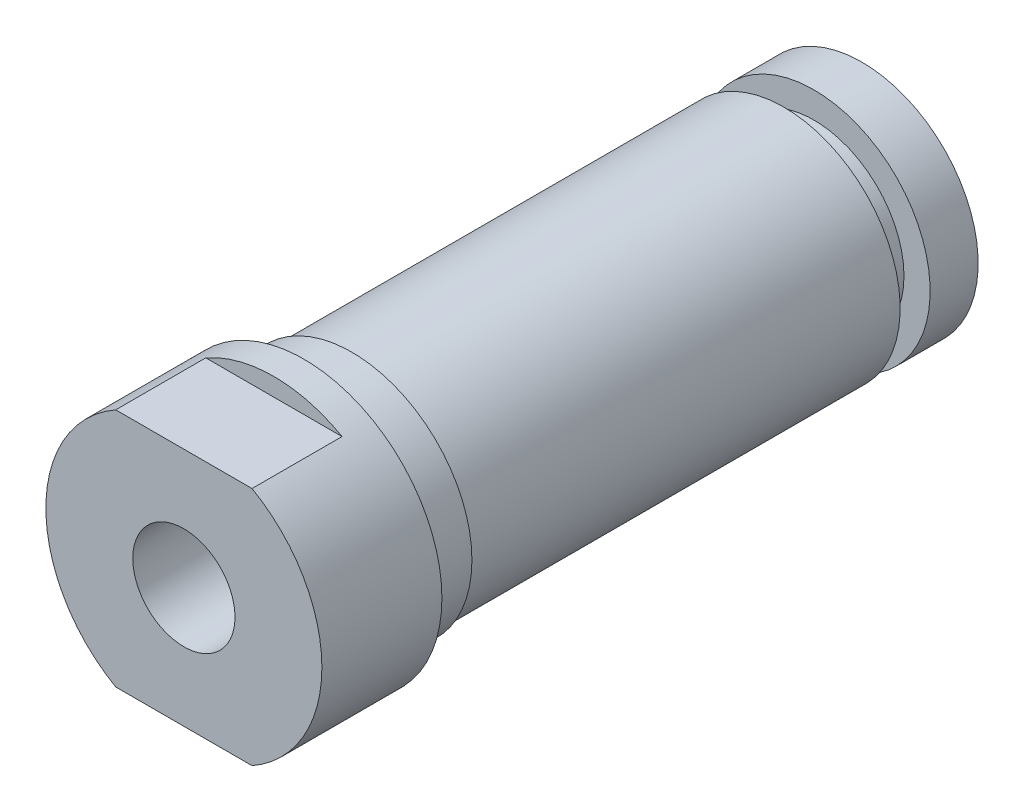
ISO-10303-21;
HEADER;
FILE_DESCRIPTION(('STEP AP214'),'2;1');
FILE_NAME('part.step','',(''),(''),'','','');
FILE_SCHEMA(('AUTOMOTIVE_DESIGN { 1 0 10303 214 1 1 1 1 }'));
ENDSEC;
DATA;
#1=APPLICATION_CONTEXT('core data for automotive mechanical design processes');
#2=APPLICATION_PROTOCOL_DEFINITION('international standard','automotive_design',2000,#1);
#3=PRODUCT_CONTEXT('',#1,'mechanical');
#4=PRODUCT('Part','Part','',(#3));
#5=PRODUCT_RELATED_PRODUCT_CATEGORY('part','',(#4));
#6=PRODUCT_DEFINITION_FORMATION('','',#4);
#7=PRODUCT_DEFINITION_CONTEXT('part definition',#1,'design');
#8=PRODUCT_DEFINITION('design','',#6,#7);
#9=PRODUCT_DEFINITION_SHAPE('','',#8);
#10=(LENGTH_UNIT() NAMED_UNIT(*) SI_UNIT(.MILLI.,.METRE.));
#11=(NAMED_UNIT(*) PLANE_ANGLE_UNIT() SI_UNIT($,.RADIAN.));
#12=(NAMED_UNIT(*) SI_UNIT($,.STERADIAN.) SOLID_ANGLE_UNIT());
#13=UNCERTAINTY_MEASURE_WITH_UNIT(LENGTH_MEASURE(1.E-05),#10,'distance_accuracy_value','');
#14=(GEOMETRIC_REPRESENTATION_CONTEXT(3) GLOBAL_UNCERTAINTY_ASSIGNED_CONTEXT((#13)) GLOBAL_UNIT_ASSIGNED_CONTEXT((#10,
#11,#12)) REPRESENTATION_CONTEXT('',''));
#15=CARTESIAN_POINT('',(0.,0.,0.));
#16=DIRECTION('',(0.,0.,1.));
#17=DIRECTION('',(1.,0.,0.));
#18=AXIS2_PLACEMENT_3D('',#15,#16,#17);
#19=CARTESIAN_POINT('',(0.,0.,0.));
#20=DIRECTION('',(0.,0.,1.));
#21=DIRECTION('',(1.,0.,0.));
#22=AXIS2_PLACEMENT_3D('',#19,#20,#21);
#23=PLANE('',#22);
#24=DIRECTION('',(1.,0.,0.));
#25=VECTOR('',#24,1.);
#26=CARTESIAN_POINT('',(-12.7,-6.35,0.));
#27=LINE('',#26,#25);
#28=CARTESIAN_POINT('',(-3.60610679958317,-6.35,0.));
#29=VERTEX_POINT('',#28);
#30=CARTESIAN_POINT('',(3.60610679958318,-6.35,0.));
#31=VERTEX_POINT('',#30);
#32=EDGE_CURVE('E91',#29,#31,#27,.T.);
#33=ORIENTED_EDGE('',*,*,#32,.T.);
#34=CARTESIAN_POINT('',(0.,0.,0.));
#35=DIRECTION('',(0.,0.,1.));
#36=DIRECTION('',(1.,0.,0.));
#37=AXIS2_PLACEMENT_3D('',#34,#35,#36);
#38=CIRCLE('',#37,7.3025);
#39=CARTESIAN_POINT('',(3.60610679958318,6.35,0.));
#40=VERTEX_POINT('',#39);
#41=EDGE_CURVE('E127',#31,#40,#38,.T.);
#42=ORIENTED_EDGE('',*,*,#41,.T.);
#43=DIRECTION('',(1.,0.,0.));
#44=VECTOR('',#43,1.);
#45=CARTESIAN_POINT('',(-12.7,6.35,0.));
#46=LINE('',#45,#44);
#47=CARTESIAN_POINT('',(-3.60610679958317,6.35,0.));
#48=VERTEX_POINT('',#47);
#49=EDGE_CURVE('E94',#48,#40,#46,.T.);
#50=ORIENTED_EDGE('',*,*,#49,.F.);
#51=EDGE_CURVE('E132',#48,#29,#38,.T.);
#52=ORIENTED_EDGE('',*,*,#51,.T.);
#53=EDGE_LOOP('',(#33,#42,#50,#52));
#54=FACE_BOUND('',#53,.T.);
#55=CARTESIAN_POINT('',(0.,0.,0.));
#56=DIRECTION('',(0.,0.,-1.));
#57=DIRECTION('',(-1.,0.,0.));
#58=AXIS2_PLACEMENT_3D('',#55,#56,#57);
#59=CIRCLE('',#58,2.70509999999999);
#60=CARTESIAN_POINT('',(-2.70509999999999,0.,0.));
#61=VERTEX_POINT('',#60);
#62=EDGE_CURVE('E98',#61,#61,#59,.T.);
#63=ORIENTED_EDGE('',*,*,#62,.T.);
#64=EDGE_LOOP('',(#63));
#65=FACE_BOUND('',#64,.T.);
#66=ADVANCED_FACE('F36',(#54,#65),#23,.T.);
#67=CARTESIAN_POINT('',(0.,0.,-31.75));
#68=DIRECTION('',(0.,0.,-1.));
#69=DIRECTION('',(-1.,0.,0.));
#70=AXIS2_PLACEMENT_3D('',#67,#68,#69);
#71=PLANE('',#70);
#72=CARTESIAN_POINT('',(0.,0.,-31.75));
#73=DIRECTION('',(0.,0.,-1.));
#74=DIRECTION('',(-1.,0.,0.));
#75=AXIS2_PLACEMENT_3D('',#72,#73,#74);
#76=CIRCLE('',#75,6.1468);
#77=CARTESIAN_POINT('',(-6.1468,0.,-31.75));
#78=VERTEX_POINT('',#77);
#79=EDGE_CURVE('E119',#78,#78,#76,.T.);
#80=ORIENTED_EDGE('',*,*,#79,.T.);
#81=EDGE_LOOP('',(#80));
#82=FACE_BOUND('',#81,.T.);
#83=CARTESIAN_POINT('',(0.,0.,-31.75));
#84=DIRECTION('',(0.,0.,-1.));
#85=DIRECTION('',(-1.,0.,0.));
#86=AXIS2_PLACEMENT_3D('',#83,#84,#85);
#87=CIRCLE('',#86,4.7625);
#88=CARTESIAN_POINT('',(-4.7625,0.,-31.75));
#89=VERTEX_POINT('',#88);
#90=EDGE_CURVE('E110',#89,#89,#87,.T.);
#91=ORIENTED_EDGE('',*,*,#90,.F.);
#92=EDGE_LOOP('',(#91));
#93=FACE_BOUND('',#92,.T.);
#94=ADVANCED_FACE('F158',(#82,#93),#71,.T.);
#95=CARTESIAN_POINT('',(0.,0.,-8.89));
#96=DIRECTION('',(0.,0.,-1.));
#97=DIRECTION('',(-1.,0.,0.));
#98=AXIS2_PLACEMENT_3D('',#95,#96,#97);
#99=PLANE('',#98);
#100=CARTESIAN_POINT('',(0.,0.,-8.89));
#101=DIRECTION('',(0.,0.,-1.));
#102=DIRECTION('',(-1.,0.,0.));
#103=AXIS2_PLACEMENT_3D('',#100,#101,#102);
#104=CIRCLE('',#103,6.35);
#105=CARTESIAN_POINT('',(-6.35,0.,-8.89));
#106=VERTEX_POINT('',#105);
#107=EDGE_CURVE('E122',#106,#106,#104,.T.);
#108=ORIENTED_EDGE('',*,*,#107,.T.);
#109=EDGE_LOOP('',(#108));
#110=FACE_BOUND('',#109,.T.);
#111=CARTESIAN_POINT('',(0.,0.,-8.89));
#112=DIRECTION('',(0.,0.,-1.));
#113=DIRECTION('',(-1.,0.,0.));
#114=AXIS2_PLACEMENT_3D('',#111,#112,#113);
#115=CIRCLE('',#114,6.1468);
#116=CARTESIAN_POINT('',(-6.1468,0.,-8.89));
#117=VERTEX_POINT('',#116);
#118=EDGE_CURVE('E116',#117,#117,#115,.T.);
#119=ORIENTED_EDGE('',*,*,#118,.F.);
#120=EDGE_LOOP('',(#119));
#121=FACE_BOUND('',#120,.T.);
#122=ADVANCED_FACE('F162',(#110,#121),#99,.T.);
#123=CARTESIAN_POINT('',(0.,0.,-6.35));
#124=DIRECTION('',(0.,0.,1.));
#125=DIRECTION('',(1.,0.,0.));
#126=AXIS2_PLACEMENT_3D('',#123,#124,#125);
#127=PLANE('',#126);
#128=CARTESIAN_POINT('',(0.,0.,-6.35));
#129=DIRECTION('',(0.,0.,1.));
#130=DIRECTION('',(1.,0.,0.));
#131=AXIS2_PLACEMENT_3D('',#128,#129,#130);
#132=CIRCLE('',#131,7.3025);
#133=CARTESIAN_POINT('',(7.3025,0.,-6.35));
#134=VERTEX_POINT('',#133);
#135=EDGE_CURVE('E128',#134,#134,#132,.T.);
#136=ORIENTED_EDGE('',*,*,#135,.F.);
#137=EDGE_LOOP('',(#136));
#138=FACE_BOUND('',#137,.T.);
#139=CARTESIAN_POINT('',(0.,0.,-6.35));
#140=DIRECTION('',(0.,0.,1.));
#141=DIRECTION('',(1.,0.,0.));
#142=AXIS2_PLACEMENT_3D('',#139,#140,#141);
#143=CIRCLE('',#142,6.35);
#144=CARTESIAN_POINT('',(6.35,0.,-6.35));
#145=VERTEX_POINT('',#144);
#146=EDGE_CURVE('E131',#145,#145,#143,.F.);
#147=ORIENTED_EDGE('',*,*,#146,.F.);
#148=EDGE_LOOP('',(#147));
#149=FACE_BOUND('',#148,.T.);
#150=ADVANCED_FACE('F166',(#138,#149),#127,.F.);
#151=CARTESIAN_POINT('',(0.,0.,-6.35));
#152=DIRECTION('',(0.,0.,1.));
#153=DIRECTION('',(1.,0.,0.));
#154=AXIS2_PLACEMENT_3D('',#151,#152,#153);
#155=CYLINDRICAL_SURFACE('',#154,7.3025);
#156=DIRECTION('',(0.,0.,1.));
#157=VECTOR('',#156,1.);
#158=CARTESIAN_POINT('',(-3.60610679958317,-6.35,-6.35));
#159=LINE('',#158,#157);
#160=CARTESIAN_POINT('',(-3.60610679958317,-6.35,-4.7625));
#161=VERTEX_POINT('',#160);
#162=EDGE_CURVE('E11',#29,#161,#159,.F.);
#163=ORIENTED_EDGE('',*,*,#162,.F.);
#164=ORIENTED_EDGE('',*,*,#51,.F.);
#165=DIRECTION('',(0.,0.,1.));
#166=VECTOR('',#165,1.);
#167=CARTESIAN_POINT('',(-3.60610679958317,6.35,-6.35));
#168=LINE('',#167,#166);
#169=CARTESIAN_POINT('',(-3.60610679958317,6.35,-4.7625));
#170=VERTEX_POINT('',#169);
#171=EDGE_CURVE('E136',#170,#48,#168,.T.);
#172=ORIENTED_EDGE('',*,*,#171,.F.);
#173=CARTESIAN_POINT('',(0.,0.,-4.7625));
#174=DIRECTION('',(0.,0.,-1.));
#175=DIRECTION('',(-1.,0.,0.));
#176=AXIS2_PLACEMENT_3D('',#173,#174,#175);
#177=CIRCLE('',#176,7.3025);
#178=CARTESIAN_POINT('',(3.60610679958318,6.35,-4.7625));
#179=VERTEX_POINT('',#178);
#180=EDGE_CURVE('E58',#179,#170,#177,.F.);
#181=ORIENTED_EDGE('',*,*,#180,.F.);
#182=DIRECTION('',(0.,0.,1.));
#183=VECTOR('',#182,1.);
#184=CARTESIAN_POINT('',(3.60610679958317,6.35,-6.35));
#185=LINE('',#184,#183);
#186=EDGE_CURVE('E85',#40,#179,#185,.F.);
#187=ORIENTED_EDGE('',*,*,#186,.F.);
#188=ORIENTED_EDGE('',*,*,#41,.F.);
#189=DIRECTION('',(0.,0.,1.));
#190=VECTOR('',#189,1.);
#191=CARTESIAN_POINT('',(3.60610679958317,-6.35,-6.35));
#192=LINE('',#191,#190);
#193=CARTESIAN_POINT('',(3.60610679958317,-6.35,-4.7625));
#194=VERTEX_POINT('',#193);
#195=EDGE_CURVE('E44',#194,#31,#192,.T.);
#196=ORIENTED_EDGE('',*,*,#195,.F.);
#197=CARTESIAN_POINT('',(0.,0.,-4.7625));
#198=DIRECTION('',(0.,0.,-1.));
#199=DIRECTION('',(-1.,0.,0.));
#200=AXIS2_PLACEMENT_3D('',#197,#198,#199);
#201=CIRCLE('',#200,7.3025);
#202=EDGE_CURVE('E77',#161,#194,#201,.F.);
#203=ORIENTED_EDGE('',*,*,#202,.F.);
#204=EDGE_LOOP('',(#163,#164,#172,#181,#187,#188,#196,#203));
#205=FACE_BOUND('',#204,.T.);
#206=ORIENTED_EDGE('',*,*,#135,.T.);
#207=EDGE_LOOP('',(#206));
#208=FACE_BOUND('',#207,.T.);
#209=ADVANCED_FACE('F38',(#205,#208),#155,.T.);
#210=CARTESIAN_POINT('',(0.,0.,-8.89));
#211=DIRECTION('',(0.,0.,1.));
#212=DIRECTION('',(1.,0.,0.));
#213=AXIS2_PLACEMENT_3D('',#210,#211,#212);
#214=CYLINDRICAL_SURFACE('',#213,6.35);
#215=ORIENTED_EDGE('',*,*,#107,.F.);
#216=EDGE_LOOP('',(#215));
#217=FACE_BOUND('',#216,.T.);
#218=ORIENTED_EDGE('',*,*,#146,.T.);
#219=EDGE_LOOP('',(#218));
#220=FACE_BOUND('',#219,.T.);
#221=ADVANCED_FACE('F170',(#217,#220),#214,.T.);
#222=CARTESIAN_POINT('',(0.,0.,-31.75));
#223=DIRECTION('',(0.,0.,1.));
#224=DIRECTION('',(1.,0.,0.));
#225=AXIS2_PLACEMENT_3D('',#222,#223,#224);
#226=CYLINDRICAL_SURFACE('',#225,6.1468);
#227=ORIENTED_EDGE('',*,*,#79,.F.);
#228=EDGE_LOOP('',(#227));
#229=FACE_BOUND('',#228,.T.);
#230=ORIENTED_EDGE('',*,*,#118,.T.);
#231=EDGE_LOOP('',(#230));
#232=FACE_BOUND('',#231,.T.);
#233=ADVANCED_FACE('F173',(#229,#232),#226,.T.);
#234=CARTESIAN_POINT('',(0.,0.,-33.3375));
#235=DIRECTION('',(0.,0.,1.));
#236=DIRECTION('',(1.,0.,0.));
#237=AXIS2_PLACEMENT_3D('',#234,#235,#236);
#238=CYLINDRICAL_SURFACE('',#237,4.7625);
#239=CARTESIAN_POINT('',(0.,0.,-33.3375));
#240=DIRECTION('',(0.,0.,-1.));
#241=DIRECTION('',(-1.,0.,0.));
#242=AXIS2_PLACEMENT_3D('',#239,#240,#241);
#243=CIRCLE('',#242,4.7625);
#244=CARTESIAN_POINT('',(-4.7625,0.,-33.3375));
#245=VERTEX_POINT('',#244);
#246=EDGE_CURVE('E113',#245,#245,#243,.T.);
#247=ORIENTED_EDGE('',*,*,#246,.F.);
#248=EDGE_LOOP('',(#247));
#249=FACE_BOUND('',#248,.T.);
#250=ORIENTED_EDGE('',*,*,#90,.T.);
#251=EDGE_LOOP('',(#250));
#252=FACE_BOUND('',#251,.T.);
#253=ADVANCED_FACE('F179',(#249,#252),#238,.T.);
#254=CARTESIAN_POINT('',(0.,0.,-33.3375));
#255=DIRECTION('',(0.,0.,-1.));
#256=DIRECTION('',(-1.,0.,0.));
#257=AXIS2_PLACEMENT_3D('',#254,#255,#256);
#258=PLANE('',#257);
#259=CARTESIAN_POINT('',(0.,0.,-33.3375));
#260=DIRECTION('',(0.,0.,-1.));
#261=DIRECTION('',(-1.,0.,0.));
#262=AXIS2_PLACEMENT_3D('',#259,#260,#261);
#263=CIRCLE('',#262,6.1468);
#264=CARTESIAN_POINT('',(-6.1468,0.,-33.3375));
#265=VERTEX_POINT('',#264);
#266=EDGE_CURVE('E106',#265,#265,#263,.T.);
#267=ORIENTED_EDGE('',*,*,#266,.F.);
#268=EDGE_LOOP('',(#267));
#269=FACE_BOUND('',#268,.T.);
#270=ORIENTED_EDGE('',*,*,#246,.T.);
#271=EDGE_LOOP('',(#270));
#272=FACE_BOUND('',#271,.T.);
#273=ADVANCED_FACE('F184',(#269,#272),#258,.F.);
#274=CARTESIAN_POINT('',(0.,0.,-35.8775));
#275=DIRECTION('',(0.,0.,1.));
#276=DIRECTION('',(1.,0.,0.));
#277=AXIS2_PLACEMENT_3D('',#274,#275,#276);
#278=CYLINDRICAL_SURFACE('',#277,6.1468);
#279=CARTESIAN_POINT('',(0.,0.,-35.8775));
#280=DIRECTION('',(0.,0.,-1.));
#281=DIRECTION('',(-1.,0.,0.));
#282=AXIS2_PLACEMENT_3D('',#279,#280,#281);
#283=CIRCLE('',#282,6.1468);
#284=CARTESIAN_POINT('',(-6.1468,0.,-35.8775));
#285=VERTEX_POINT('',#284);
#286=EDGE_CURVE('E107',#285,#285,#283,.T.);
#287=ORIENTED_EDGE('',*,*,#286,.F.);
#288=EDGE_LOOP('',(#287));
#289=FACE_BOUND('',#288,.T.);
#290=ORIENTED_EDGE('',*,*,#266,.T.);
#291=EDGE_LOOP('',(#290));
#292=FACE_BOUND('',#291,.T.);
#293=ADVANCED_FACE('F186',(#289,#292),#278,.T.);
#294=CARTESIAN_POINT('',(0.,0.,-35.8775));
#295=DIRECTION('',(0.,0.,-1.));
#296=DIRECTION('',(-1.,0.,0.));
#297=AXIS2_PLACEMENT_3D('',#294,#295,#296);
#298=PLANE('',#297);
#299=CARTESIAN_POINT('',(0.,0.,-35.8775));
#300=DIRECTION('',(0.,0.,-1.));
#301=DIRECTION('',(-1.,0.,0.));
#302=AXIS2_PLACEMENT_3D('',#299,#300,#301);
#303=CIRCLE('',#302,2.70509999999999);
#304=CARTESIAN_POINT('',(-2.70509999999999,0.,-35.8775));
#305=VERTEX_POINT('',#304);
#306=EDGE_CURVE('E103',#305,#305,#303,.T.);
#307=ORIENTED_EDGE('',*,*,#306,.F.);
#308=EDGE_LOOP('',(#307));
#309=FACE_BOUND('',#308,.T.);
#310=ORIENTED_EDGE('',*,*,#286,.T.);
#311=EDGE_LOOP('',(#310));
#312=FACE_BOUND('',#311,.T.);
#313=ADVANCED_FACE('F153',(#309,#312),#298,.T.);
#314=CARTESIAN_POINT('',(0.,0.,-35.8775));
#315=DIRECTION('',(0.,0.,-1.));
#316=DIRECTION('',(-1.,0.,0.));
#317=AXIS2_PLACEMENT_3D('',#314,#315,#316);
#318=CYLINDRICAL_SURFACE('',#317,2.70509999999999);
#319=ORIENTED_EDGE('',*,*,#62,.F.);
#320=EDGE_LOOP('',(#319));
#321=FACE_BOUND('',#320,.T.);
#322=ORIENTED_EDGE('',*,*,#306,.T.);
#323=EDGE_LOOP('',(#322));
#324=FACE_BOUND('',#323,.T.);
#325=ADVANCED_FACE('F146',(#321,#324),#318,.F.);
#326=CARTESIAN_POINT('',(-12.7,7.3025,-4.7625));
#327=DIRECTION('',(0.,0.,-1.));
#328=DIRECTION('',(-1.,0.,0.));
#329=AXIS2_PLACEMENT_3D('',#326,#327,#328);
#330=PLANE('',#329);
#331=DIRECTION('',(1.,0.,0.));
#332=VECTOR('',#331,1.);
#333=CARTESIAN_POINT('',(-12.7,6.35,-4.7625));
#334=LINE('',#333,#332);
#335=EDGE_CURVE('E51',#170,#179,#334,.T.);
#336=ORIENTED_EDGE('',*,*,#335,.T.);
#337=ORIENTED_EDGE('',*,*,#180,.T.);
#338=EDGE_LOOP('',(#336,#337));
#339=FACE_BOUND('',#338,.T.);
#340=ADVANCED_FACE('F144',(#339),#330,.F.);
#341=CARTESIAN_POINT('',(-12.7,6.35,0.));
#342=DIRECTION('',(0.,-1.,0.));
#343=DIRECTION('',(0.,0.,-1.));
#344=AXIS2_PLACEMENT_3D('',#341,#342,#343);
#345=PLANE('',#344);
#346=ORIENTED_EDGE('',*,*,#186,.T.);
#347=ORIENTED_EDGE('',*,*,#335,.F.);
#348=ORIENTED_EDGE('',*,*,#171,.T.);
#349=ORIENTED_EDGE('',*,*,#49,.T.);
#350=EDGE_LOOP('',(#346,#347,#348,#349));
#351=FACE_BOUND('',#350,.T.);
#352=ADVANCED_FACE('F142',(#351),#345,.F.);
#353=CARTESIAN_POINT('',(-12.7,-6.35,0.));
#354=DIRECTION('',(0.,1.,0.));
#355=DIRECTION('',(0.,0.,1.));
#356=AXIS2_PLACEMENT_3D('',#353,#354,#355);
#357=PLANE('',#356);
#358=ORIENTED_EDGE('',*,*,#162,.T.);
#359=DIRECTION('',(1.,0.,0.));
#360=VECTOR('',#359,1.);
#361=CARTESIAN_POINT('',(-12.7,-6.35,-4.7625));
#362=LINE('',#361,#360);
#363=EDGE_CURVE('E89',#161,#194,#362,.T.);
#364=ORIENTED_EDGE('',*,*,#363,.T.);
#365=ORIENTED_EDGE('',*,*,#195,.T.);
#366=ORIENTED_EDGE('',*,*,#32,.F.);
#367=EDGE_LOOP('',(#358,#364,#365,#366));
#368=FACE_BOUND('',#367,.T.);
#369=ADVANCED_FACE('F88',(#368),#357,.F.);
#370=CARTESIAN_POINT('',(-12.7,-7.3025,-4.7625));
#371=DIRECTION('',(0.,0.,-1.));
#372=DIRECTION('',(-1.,0.,0.));
#373=AXIS2_PLACEMENT_3D('',#370,#371,#372);
#374=PLANE('',#373);
#375=ORIENTED_EDGE('',*,*,#363,.F.);
#376=ORIENTED_EDGE('',*,*,#202,.T.);
#377=EDGE_LOOP('',(#375,#376));
#378=FACE_BOUND('',#377,.T.);
#379=ADVANCED_FACE('F92',(#378),#374,.F.);
#380=CLOSED_SHELL('',(#66,#94,#122,#150,#209,#221,#233,#253,#273,#293,#313,#325,#340,#352,#369,#379));
#381=MANIFOLD_SOLID_BREP('B2',#380);
#382=ADVANCED_BREP_SHAPE_REPRESENTATION('',(#18,#381),#14);
#383=SHAPE_DEFINITION_REPRESENTATION(#9,#382);
ENDSEC;
END-ISO-10303-21;
